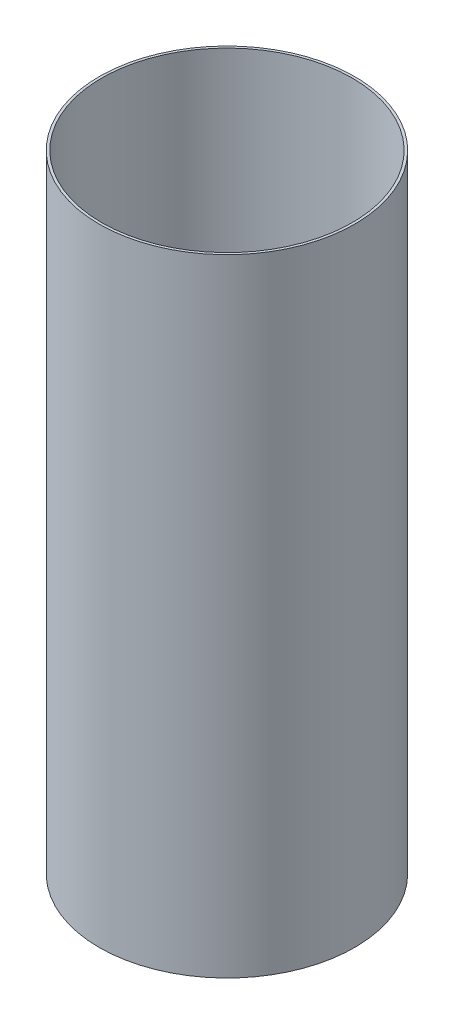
ISO-10303-21;
HEADER;
FILE_DESCRIPTION(('STEP AP214'),'2;1');
FILE_NAME('part.step','',(''),(''),'','','');
FILE_SCHEMA(('AUTOMOTIVE_DESIGN { 1 0 10303 214 1 1 1 1 }'));
ENDSEC;
DATA;
#1=APPLICATION_CONTEXT('core data for automotive mechanical design processes');
#2=APPLICATION_PROTOCOL_DEFINITION('international standard','automotive_design',2000,#1);
#3=PRODUCT_CONTEXT('',#1,'mechanical');
#4=PRODUCT('Part','Part','',(#3));
#5=PRODUCT_RELATED_PRODUCT_CATEGORY('part','',(#4));
#6=PRODUCT_DEFINITION_FORMATION('','',#4);
#7=PRODUCT_DEFINITION_CONTEXT('part definition',#1,'design');
#8=PRODUCT_DEFINITION('design','',#6,#7);
#9=PRODUCT_DEFINITION_SHAPE('','',#8);
#10=(LENGTH_UNIT() NAMED_UNIT(*) SI_UNIT(.MILLI.,.METRE.));
#11=(NAMED_UNIT(*) PLANE_ANGLE_UNIT() SI_UNIT($,.RADIAN.));
#12=(NAMED_UNIT(*) SI_UNIT($,.STERADIAN.) SOLID_ANGLE_UNIT());
#13=UNCERTAINTY_MEASURE_WITH_UNIT(LENGTH_MEASURE(1.E-05),#10,'distance_accuracy_value','');
#14=(GEOMETRIC_REPRESENTATION_CONTEXT(3) GLOBAL_UNCERTAINTY_ASSIGNED_CONTEXT((#13)) GLOBAL_UNIT_ASSIGNED_CONTEXT((#10,
#11,#12)) REPRESENTATION_CONTEXT('',''));
#15=CARTESIAN_POINT('',(0.,0.,0.));
#16=DIRECTION('',(0.,0.,1.));
#17=DIRECTION('',(1.,0.,0.));
#18=AXIS2_PLACEMENT_3D('',#15,#16,#17);
#19=CARTESIAN_POINT('',(0.,6.35,0.));
#20=DIRECTION('',(0.,1.,0.));
#21=DIRECTION('',(0.,0.,1.));
#22=AXIS2_PLACEMENT_3D('',#19,#20,#21);
#23=PLANE('',#22);
#24=CARTESIAN_POINT('',(0.,6.35,0.));
#25=DIRECTION('',(0.,1.,0.));
#26=DIRECTION('',(0.,0.,1.));
#27=AXIS2_PLACEMENT_3D('',#24,#25,#26);
#28=CIRCLE('',#27,1.2954);
#29=CARTESIAN_POINT('',(0.,6.35,1.2954));
#30=VERTEX_POINT('',#29);
#31=EDGE_CURVE('E10',#30,#30,#28,.T.);
#32=ORIENTED_EDGE('',*,*,#31,.T.);
#33=EDGE_LOOP('',(#32));
#34=FACE_BOUND('',#33,.T.);
#35=CARTESIAN_POINT('',(0.,6.35,0.));
#36=DIRECTION('',(0.,1.,0.));
#37=DIRECTION('',(0.,0.,1.));
#38=AXIS2_PLACEMENT_3D('',#35,#36,#37);
#39=CIRCLE('',#38,1.27);
#40=CARTESIAN_POINT('',(0.,6.35,1.27));
#41=VERTEX_POINT('',#40);
#42=EDGE_CURVE('E49',#41,#41,#39,.T.);
#43=ORIENTED_EDGE('',*,*,#42,.F.);
#44=EDGE_LOOP('',(#43));
#45=FACE_BOUND('',#44,.T.);
#46=ADVANCED_FACE('F37',(#34,#45),#23,.T.);
#47=CARTESIAN_POINT('',(0.,0.,0.));
#48=DIRECTION('',(0.,1.,0.));
#49=DIRECTION('',(0.,0.,1.));
#50=AXIS2_PLACEMENT_3D('',#47,#48,#49);
#51=PLANE('',#50);
#52=CARTESIAN_POINT('',(0.,0.,0.));
#53=DIRECTION('',(0.,1.,0.));
#54=DIRECTION('',(0.,0.,1.));
#55=AXIS2_PLACEMENT_3D('',#52,#53,#54);
#56=CIRCLE('',#55,1.2954);
#57=CARTESIAN_POINT('',(0.,0.,1.2954));
#58=VERTEX_POINT('',#57);
#59=EDGE_CURVE('E41',#58,#58,#56,.T.);
#60=ORIENTED_EDGE('',*,*,#59,.F.);
#61=EDGE_LOOP('',(#60));
#62=FACE_BOUND('',#61,.T.);
#63=CARTESIAN_POINT('',(0.,0.,0.));
#64=DIRECTION('',(0.,1.,0.));
#65=DIRECTION('',(0.,0.,1.));
#66=AXIS2_PLACEMENT_3D('',#63,#64,#65);
#67=CIRCLE('',#66,1.27);
#68=CARTESIAN_POINT('',(0.,0.,1.27));
#69=VERTEX_POINT('',#68);
#70=EDGE_CURVE('E51',#69,#69,#67,.T.);
#71=ORIENTED_EDGE('',*,*,#70,.T.);
#72=EDGE_LOOP('',(#71));
#73=FACE_BOUND('',#72,.T.);
#74=ADVANCED_FACE('F62',(#62,#73),#51,.F.);
#75=CARTESIAN_POINT('',(0.,6.35,0.));
#76=DIRECTION('',(0.,-1.,0.));
#77=DIRECTION('',(0.,0.,-1.));
#78=AXIS2_PLACEMENT_3D('',#75,#76,#77);
#79=CYLINDRICAL_SURFACE('',#78,1.2954);
#80=ORIENTED_EDGE('',*,*,#31,.F.);
#81=EDGE_LOOP('',(#80));
#82=FACE_BOUND('',#81,.T.);
#83=ORIENTED_EDGE('',*,*,#59,.T.);
#84=EDGE_LOOP('',(#83));
#85=FACE_BOUND('',#84,.T.);
#86=ADVANCED_FACE('F39',(#82,#85),#79,.T.);
#87=CARTESIAN_POINT('',(0.,6.35,0.));
#88=DIRECTION('',(0.,-1.,0.));
#89=DIRECTION('',(0.,0.,-1.));
#90=AXIS2_PLACEMENT_3D('',#87,#88,#89);
#91=CYLINDRICAL_SURFACE('',#90,1.27);
#92=ORIENTED_EDGE('',*,*,#42,.T.);
#93=EDGE_LOOP('',(#92));
#94=FACE_BOUND('',#93,.T.);
#95=ORIENTED_EDGE('',*,*,#70,.F.);
#96=EDGE_LOOP('',(#95));
#97=FACE_BOUND('',#96,.T.);
#98=ADVANCED_FACE('F58',(#94,#97),#91,.F.);
#99=CLOSED_SHELL('',(#46,#74,#86,#98));
#100=MANIFOLD_SOLID_BREP('B2',#99);
#101=ADVANCED_BREP_SHAPE_REPRESENTATION('',(#18,#100),#14);
#102=SHAPE_DEFINITION_REPRESENTATION(#9,#101);
ENDSEC;
END-ISO-10303-21;
